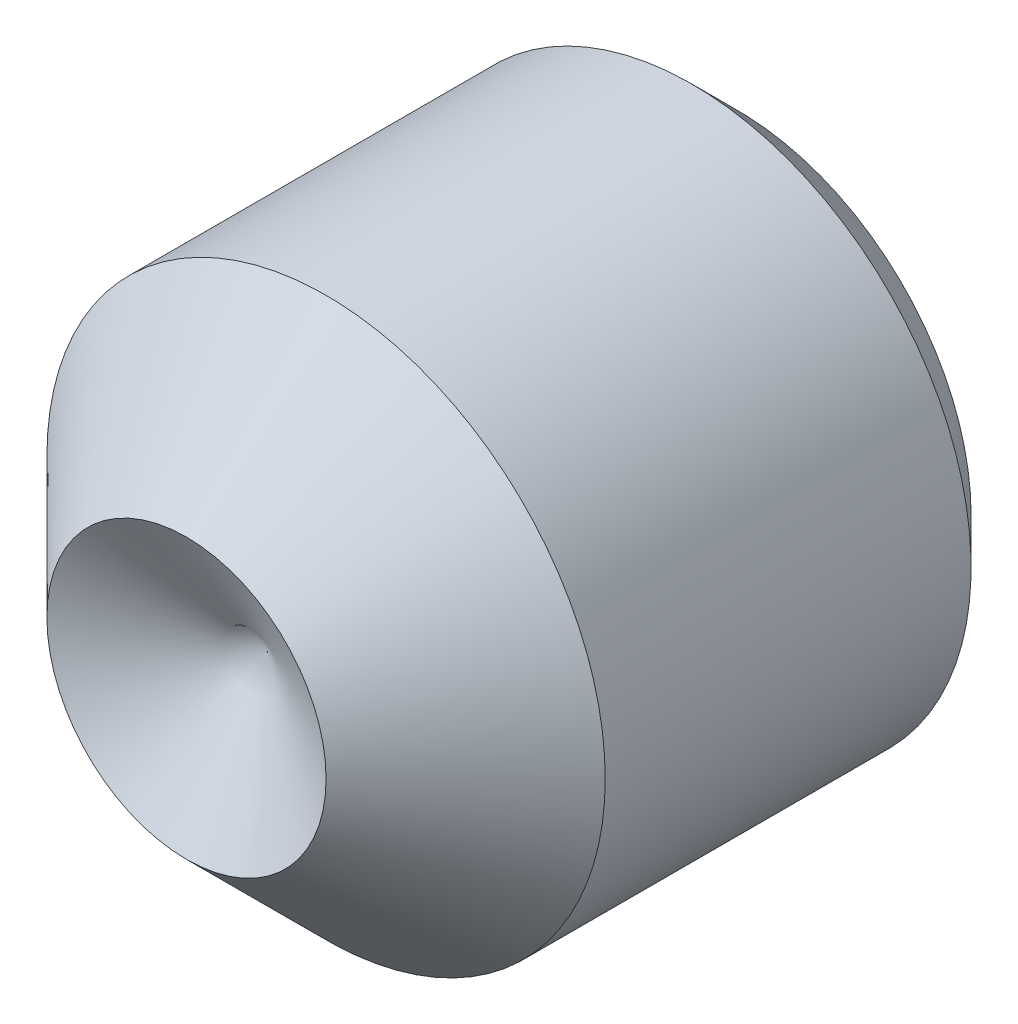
from build123d import *

# Parameters (mm, degrees)
CUT_EXTRUDE1_DEPTH = 2.5


with BuildPart() as part:
    # Logo3_bib1 → Revolve1 (revolve)
    with BuildSketch(Plane(origin=(0, 0, 0), x_dir=(-1, 0, 0), z_dir=(0, -1, 0))):
        Polygon((0, -4.7625), (0, 0), (2.0193, 0), (2.413, -0.3937), (2.413, -4.3688), (2.0193, -4.7625), align=None)
    revolve(axis=Axis((0, 0, -10.585154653), (0, 0, 1)))

    # Logo3_bib11 → Cut-Extrude1 (cut)
    with BuildSketch(Plane(origin=(0, 0, 0), x_dir=(1, 0, 0), z_dir=(0, 0, -1))):
        Polygon((1.374082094, 0), (0.687041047, 1.18999), (-0.687041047, 1.18999), (-1.374082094, 0), (-0.687041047, -1.18999), (0.687041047, -1.18999), align=None)
    extrude(amount=-CUT_EXTRUDE1_DEPTH, mode=Mode.SUBTRACT)

    # Logo3_bib3 → Type3 (revolve, cut)
    with BuildSketch(Plane(origin=(0, 0, 0), x_dir=(1, 0, 0), z_dir=(0, 1, 0)), mode=Mode.PRIVATE) as type3_sk:
        Polygon((-1.2065, -4.7625), (-2.413, -3.556), (-3.413, -3.556), (-3.413, -5.7625), (0, -5.7625), (0, -4.0659269), align=None)
    revolve(type3_sk.sketch.rotate(Axis((0, 0, 43.517168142), (0, 0, -1)), 180), axis=Axis((0, 0, 43.517168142), (0, 0, -1)), mode=Mode.SUBTRACT)


solid = part.part
